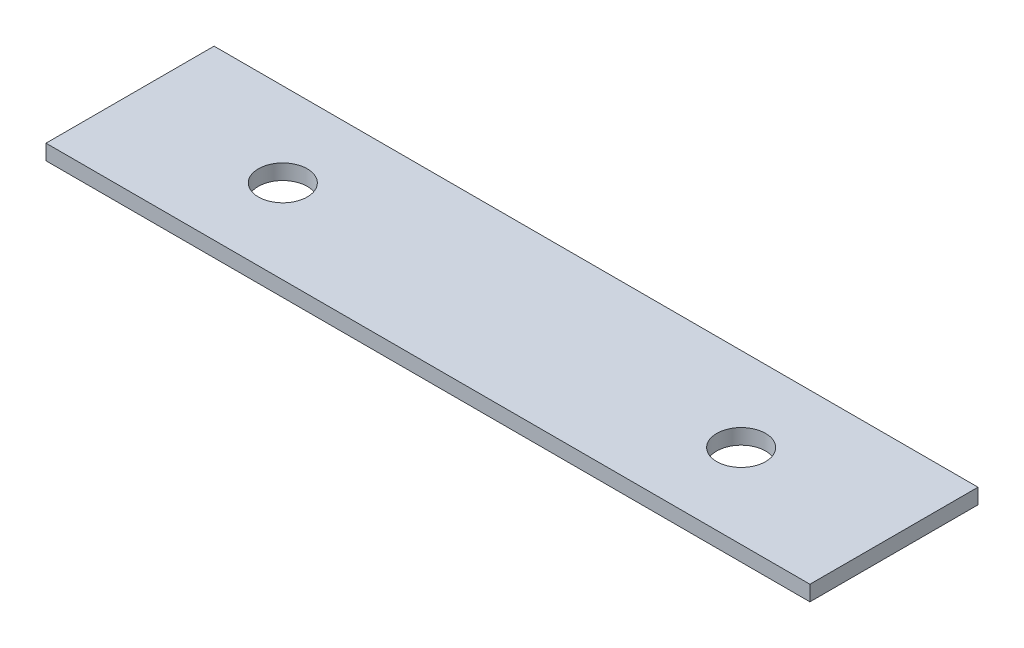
ISO-10303-21;
HEADER;
FILE_DESCRIPTION(('STEP AP214'),'2;1');
FILE_NAME('part.step','',(''),(''),'','','');
FILE_SCHEMA(('AUTOMOTIVE_DESIGN { 1 0 10303 214 1 1 1 1 }'));
ENDSEC;
DATA;
#1=APPLICATION_CONTEXT('core data for automotive mechanical design processes');
#2=APPLICATION_PROTOCOL_DEFINITION('international standard','automotive_design',2000,#1);
#3=PRODUCT_CONTEXT('',#1,'mechanical');
#4=PRODUCT('Part','Part','',(#3));
#5=PRODUCT_RELATED_PRODUCT_CATEGORY('part','',(#4));
#6=PRODUCT_DEFINITION_FORMATION('','',#4);
#7=PRODUCT_DEFINITION_CONTEXT('part definition',#1,'design');
#8=PRODUCT_DEFINITION('design','',#6,#7);
#9=PRODUCT_DEFINITION_SHAPE('','',#8);
#10=(LENGTH_UNIT() NAMED_UNIT(*) SI_UNIT(.MILLI.,.METRE.));
#11=(NAMED_UNIT(*) PLANE_ANGLE_UNIT() SI_UNIT($,.RADIAN.));
#12=(NAMED_UNIT(*) SI_UNIT($,.STERADIAN.) SOLID_ANGLE_UNIT());
#13=UNCERTAINTY_MEASURE_WITH_UNIT(LENGTH_MEASURE(1.E-05),#10,'distance_accuracy_value','');
#14=(GEOMETRIC_REPRESENTATION_CONTEXT(3) GLOBAL_UNCERTAINTY_ASSIGNED_CONTEXT((#13)) GLOBAL_UNIT_ASSIGNED_CONTEXT((#10,
#11,#12)) REPRESENTATION_CONTEXT('',''));
#15=CARTESIAN_POINT('',(0.,0.,0.));
#16=DIRECTION('',(0.,0.,1.));
#17=DIRECTION('',(1.,0.,0.));
#18=AXIS2_PLACEMENT_3D('',#15,#16,#17);
#19=CARTESIAN_POINT('',(40.,1.,5.49999999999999));
#20=DIRECTION('',(0.,-1.,0.));
#21=DIRECTION('',(0.,0.,-1.));
#22=AXIS2_PLACEMENT_3D('',#19,#20,#21);
#23=PLANE('',#22);
#24=CARTESIAN_POINT('',(0.,1.,0.));
#25=DIRECTION('',(0.,1.,0.));
#26=DIRECTION('',(0.,0.,1.));
#27=AXIS2_PLACEMENT_3D('',#24,#25,#26);
#28=CIRCLE('',#27,1.6);
#29=CARTESIAN_POINT('',(0.,1.,1.6));
#30=VERTEX_POINT('',#29);
#31=EDGE_CURVE('E89',#30,#30,#28,.T.);
#32=ORIENTED_EDGE('',*,*,#31,.F.);
#33=EDGE_LOOP('',(#32));
#34=FACE_BOUND('',#33,.T.);
#35=DIRECTION('',(0.,0.,-1.));
#36=VECTOR('',#35,1.);
#37=CARTESIAN_POINT('',(40.,1.,-5.49999999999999));
#38=LINE('',#37,#36);
#39=CARTESIAN_POINT('',(40.,1.,5.49999999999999));
#40=VERTEX_POINT('',#39);
#41=CARTESIAN_POINT('',(40.,1.,-5.49999999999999));
#42=VERTEX_POINT('',#41);
#43=EDGE_CURVE('E99',#40,#42,#38,.T.);
#44=ORIENTED_EDGE('',*,*,#43,.T.);
#45=DIRECTION('',(-1.,0.,0.));
#46=VECTOR('',#45,1.);
#47=CARTESIAN_POINT('',(40.,1.,-5.49999999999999));
#48=LINE('',#47,#46);
#49=CARTESIAN_POINT('',(-10.,1.,-5.5));
#50=VERTEX_POINT('',#49);
#51=EDGE_CURVE('E84',#42,#50,#48,.T.);
#52=ORIENTED_EDGE('',*,*,#51,.T.);
#53=DIRECTION('',(0.,0.,1.));
#54=VECTOR('',#53,1.);
#55=CARTESIAN_POINT('',(-10.,1.,-5.5));
#56=LINE('',#55,#54);
#57=CARTESIAN_POINT('',(-10.,1.,5.5));
#58=VERTEX_POINT('',#57);
#59=EDGE_CURVE('E50',#50,#58,#56,.T.);
#60=ORIENTED_EDGE('',*,*,#59,.T.);
#61=DIRECTION('',(1.,0.,0.));
#62=VECTOR('',#61,1.);
#63=CARTESIAN_POINT('',(40.,1.,5.49999999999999));
#64=LINE('',#63,#62);
#65=EDGE_CURVE('E45',#58,#40,#64,.T.);
#66=ORIENTED_EDGE('',*,*,#65,.T.);
#67=EDGE_LOOP('',(#44,#52,#60,#66));
#68=FACE_BOUND('',#67,.T.);
#69=CARTESIAN_POINT('',(30.,1.,0.));
#70=DIRECTION('',(0.,1.,0.));
#71=DIRECTION('',(0.,0.,1.));
#72=AXIS2_PLACEMENT_3D('',#69,#70,#71);
#73=CIRCLE('',#72,1.6);
#74=CARTESIAN_POINT('',(30.,1.,1.6));
#75=VERTEX_POINT('',#74);
#76=EDGE_CURVE('E117',#75,#75,#73,.T.);
#77=ORIENTED_EDGE('',*,*,#76,.F.);
#78=EDGE_LOOP('',(#77));
#79=FACE_BOUND('',#78,.T.);
#80=ADVANCED_FACE('F30',(#34,#68,#79),#23,.F.);
#81=CARTESIAN_POINT('',(40.,0.,5.49999999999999));
#82=DIRECTION('',(0.,-1.,0.));
#83=DIRECTION('',(0.,0.,-1.));
#84=AXIS2_PLACEMENT_3D('',#81,#82,#83);
#85=PLANE('',#84);
#86=CARTESIAN_POINT('',(0.,0.,0.));
#87=DIRECTION('',(0.,1.,0.));
#88=DIRECTION('',(0.,0.,1.));
#89=AXIS2_PLACEMENT_3D('',#86,#87,#88);
#90=CIRCLE('',#89,1.6);
#91=CARTESIAN_POINT('',(0.,0.,1.6));
#92=VERTEX_POINT('',#91);
#93=EDGE_CURVE('E92',#92,#92,#90,.T.);
#94=ORIENTED_EDGE('',*,*,#93,.T.);
#95=EDGE_LOOP('',(#94));
#96=FACE_BOUND('',#95,.T.);
#97=DIRECTION('',(0.,0.,-1.));
#98=VECTOR('',#97,1.);
#99=CARTESIAN_POINT('',(40.,0.,-5.49999999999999));
#100=LINE('',#99,#98);
#101=CARTESIAN_POINT('',(40.,0.,5.49999999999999));
#102=VERTEX_POINT('',#101);
#103=CARTESIAN_POINT('',(40.,0.,-5.49999999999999));
#104=VERTEX_POINT('',#103);
#105=EDGE_CURVE('E76',#102,#104,#100,.T.);
#106=ORIENTED_EDGE('',*,*,#105,.F.);
#107=DIRECTION('',(1.,0.,0.));
#108=VECTOR('',#107,1.);
#109=CARTESIAN_POINT('',(40.,0.,5.49999999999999));
#110=LINE('',#109,#108);
#111=CARTESIAN_POINT('',(-10.,0.,5.5));
#112=VERTEX_POINT('',#111);
#113=EDGE_CURVE('E97',#112,#102,#110,.T.);
#114=ORIENTED_EDGE('',*,*,#113,.F.);
#115=DIRECTION('',(0.,0.,1.));
#116=VECTOR('',#115,1.);
#117=CARTESIAN_POINT('',(-10.,0.,-5.5));
#118=LINE('',#117,#116);
#119=CARTESIAN_POINT('',(-10.,0.,-5.5));
#120=VERTEX_POINT('',#119);
#121=EDGE_CURVE('E77',#120,#112,#118,.T.);
#122=ORIENTED_EDGE('',*,*,#121,.F.);
#123=DIRECTION('',(-1.,0.,0.));
#124=VECTOR('',#123,1.);
#125=CARTESIAN_POINT('',(40.,0.,-5.49999999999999));
#126=LINE('',#125,#124);
#127=EDGE_CURVE('E71',#104,#120,#126,.T.);
#128=ORIENTED_EDGE('',*,*,#127,.F.);
#129=EDGE_LOOP('',(#106,#114,#122,#128));
#130=FACE_BOUND('',#129,.T.);
#131=CARTESIAN_POINT('',(30.,0.,0.));
#132=DIRECTION('',(0.,1.,0.));
#133=DIRECTION('',(0.,0.,1.));
#134=AXIS2_PLACEMENT_3D('',#131,#132,#133);
#135=CIRCLE('',#134,1.6);
#136=CARTESIAN_POINT('',(30.,0.,1.6));
#137=VERTEX_POINT('',#136);
#138=EDGE_CURVE('E119',#137,#137,#135,.T.);
#139=ORIENTED_EDGE('',*,*,#138,.T.);
#140=EDGE_LOOP('',(#139));
#141=FACE_BOUND('',#140,.T.);
#142=ADVANCED_FACE('F72',(#96,#130,#141),#85,.T.);
#143=CARTESIAN_POINT('',(40.,1.,-5.49999999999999));
#144=DIRECTION('',(-1.,0.,0.));
#145=DIRECTION('',(0.,0.,1.));
#146=AXIS2_PLACEMENT_3D('',#143,#144,#145);
#147=PLANE('',#146);
#148=ORIENTED_EDGE('',*,*,#105,.T.);
#149=DIRECTION('',(0.,-1.,0.));
#150=VECTOR('',#149,1.);
#151=CARTESIAN_POINT('',(40.,1.,-5.49999999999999));
#152=LINE('',#151,#150);
#153=EDGE_CURVE('E11',#42,#104,#152,.T.);
#154=ORIENTED_EDGE('',*,*,#153,.F.);
#155=ORIENTED_EDGE('',*,*,#43,.F.);
#156=DIRECTION('',(0.,-1.,0.));
#157=VECTOR('',#156,1.);
#158=CARTESIAN_POINT('',(40.,1.,5.49999999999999));
#159=LINE('',#158,#157);
#160=EDGE_CURVE('E88',#40,#102,#159,.T.);
#161=ORIENTED_EDGE('',*,*,#160,.T.);
#162=EDGE_LOOP('',(#148,#154,#155,#161));
#163=FACE_BOUND('',#162,.T.);
#164=ADVANCED_FACE('F32',(#163),#147,.F.);
#165=CARTESIAN_POINT('',(40.,1.,-5.49999999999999));
#166=DIRECTION('',(0.,0.,1.));
#167=DIRECTION('',(1.,0.,0.));
#168=AXIS2_PLACEMENT_3D('',#165,#166,#167);
#169=PLANE('',#168);
#170=ORIENTED_EDGE('',*,*,#127,.T.);
#171=DIRECTION('',(0.,-1.,0.));
#172=VECTOR('',#171,1.);
#173=CARTESIAN_POINT('',(-10.,1.,-5.5));
#174=LINE('',#173,#172);
#175=EDGE_CURVE('E38',#50,#120,#174,.T.);
#176=ORIENTED_EDGE('',*,*,#175,.F.);
#177=ORIENTED_EDGE('',*,*,#51,.F.);
#178=ORIENTED_EDGE('',*,*,#153,.T.);
#179=EDGE_LOOP('',(#170,#176,#177,#178));
#180=FACE_BOUND('',#179,.T.);
#181=ADVANCED_FACE('F83',(#180),#169,.F.);
#182=CARTESIAN_POINT('',(-10.,1.,-5.5));
#183=DIRECTION('',(1.,0.,0.));
#184=DIRECTION('',(0.,0.,-1.));
#185=AXIS2_PLACEMENT_3D('',#182,#183,#184);
#186=PLANE('',#185);
#187=ORIENTED_EDGE('',*,*,#121,.T.);
#188=DIRECTION('',(0.,-1.,0.));
#189=VECTOR('',#188,1.);
#190=CARTESIAN_POINT('',(-10.,1.,5.5));
#191=LINE('',#190,#189);
#192=EDGE_CURVE('E105',#58,#112,#191,.T.);
#193=ORIENTED_EDGE('',*,*,#192,.F.);
#194=ORIENTED_EDGE('',*,*,#59,.F.);
#195=ORIENTED_EDGE('',*,*,#175,.T.);
#196=EDGE_LOOP('',(#187,#193,#194,#195));
#197=FACE_BOUND('',#196,.T.);
#198=ADVANCED_FACE('F108',(#197),#186,.F.);
#199=CARTESIAN_POINT('',(40.,1.,5.49999999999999));
#200=DIRECTION('',(0.,0.,-1.));
#201=DIRECTION('',(-1.,0.,0.));
#202=AXIS2_PLACEMENT_3D('',#199,#200,#201);
#203=PLANE('',#202);
#204=ORIENTED_EDGE('',*,*,#113,.T.);
#205=ORIENTED_EDGE('',*,*,#160,.F.);
#206=ORIENTED_EDGE('',*,*,#65,.F.);
#207=ORIENTED_EDGE('',*,*,#192,.T.);
#208=EDGE_LOOP('',(#204,#205,#206,#207));
#209=FACE_BOUND('',#208,.T.);
#210=ADVANCED_FACE('F110',(#209),#203,.F.);
#211=CARTESIAN_POINT('',(0.,1.,0.));
#212=DIRECTION('',(0.,-1.,0.));
#213=DIRECTION('',(0.,0.,-1.));
#214=AXIS2_PLACEMENT_3D('',#211,#212,#213);
#215=CYLINDRICAL_SURFACE('',#214,1.6);
#216=ORIENTED_EDGE('',*,*,#31,.T.);
#217=EDGE_LOOP('',(#216));
#218=FACE_BOUND('',#217,.T.);
#219=ORIENTED_EDGE('',*,*,#93,.F.);
#220=EDGE_LOOP('',(#219));
#221=FACE_BOUND('',#220,.T.);
#222=ADVANCED_FACE('F128',(#218,#221),#215,.F.);
#223=CARTESIAN_POINT('',(30.,1.,0.));
#224=DIRECTION('',(0.,-1.,0.));
#225=DIRECTION('',(0.,0.,-1.));
#226=AXIS2_PLACEMENT_3D('',#223,#224,#225);
#227=CYLINDRICAL_SURFACE('',#226,1.6);
#228=ORIENTED_EDGE('',*,*,#76,.T.);
#229=EDGE_LOOP('',(#228));
#230=FACE_BOUND('',#229,.T.);
#231=ORIENTED_EDGE('',*,*,#138,.F.);
#232=EDGE_LOOP('',(#231));
#233=FACE_BOUND('',#232,.T.);
#234=ADVANCED_FACE('F126',(#230,#233),#227,.F.);
#235=CLOSED_SHELL('',(#80,#142,#164,#181,#198,#210,#222,#234));
#236=MANIFOLD_SOLID_BREP('B2',#235);
#237=ADVANCED_BREP_SHAPE_REPRESENTATION('',(#18,#236),#14);
#238=SHAPE_DEFINITION_REPRESENTATION(#9,#237);
ENDSEC;
END-ISO-10303-21;
